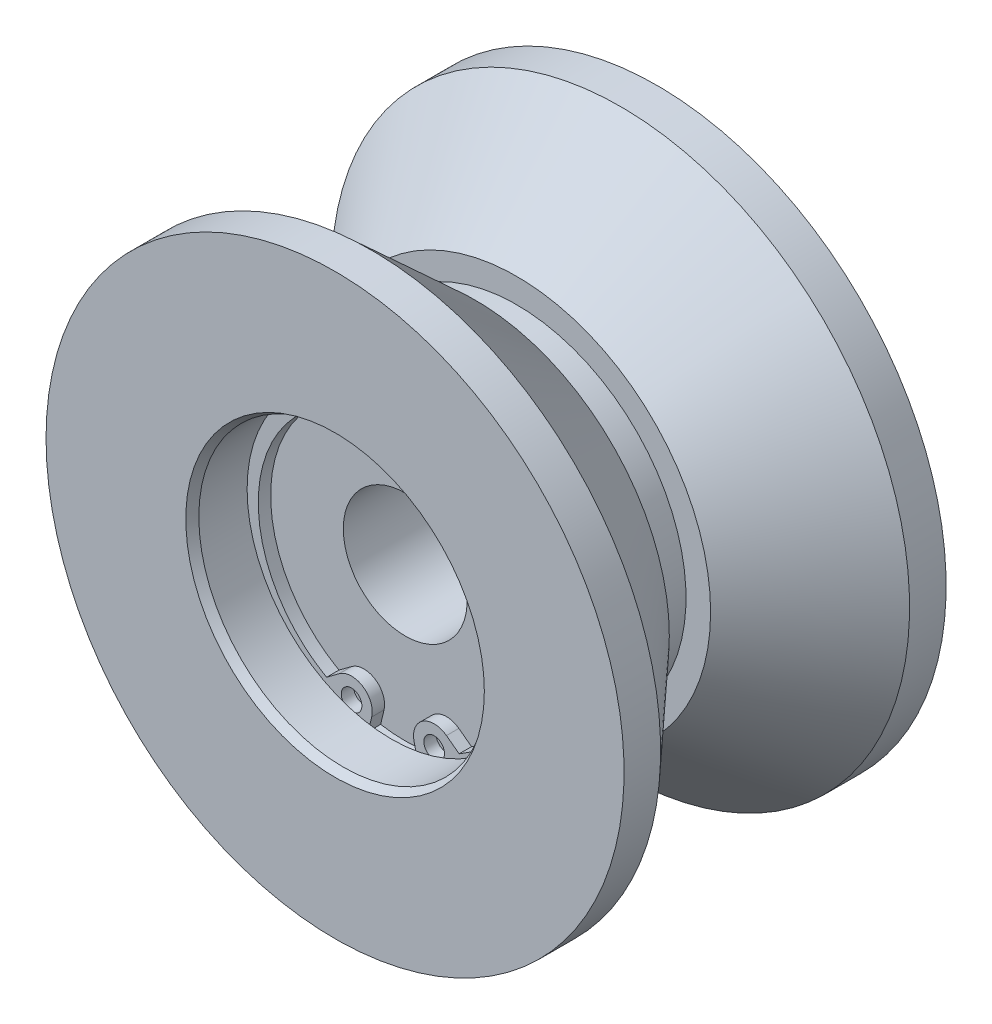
ISO-10303-21;
HEADER;
FILE_DESCRIPTION(('STEP AP214'),'2;1');
FILE_NAME('part.step','',(''),(''),'','','');
FILE_SCHEMA(('AUTOMOTIVE_DESIGN { 1 0 10303 214 1 1 1 1 }'));
ENDSEC;
DATA;
#1=APPLICATION_CONTEXT('core data for automotive mechanical design processes');
#2=APPLICATION_PROTOCOL_DEFINITION('international standard','automotive_design',2000,#1);
#3=PRODUCT_CONTEXT('',#1,'mechanical');
#4=PRODUCT('Part','Part','',(#3));
#5=PRODUCT_RELATED_PRODUCT_CATEGORY('part','',(#4));
#6=PRODUCT_DEFINITION_FORMATION('','',#4);
#7=PRODUCT_DEFINITION_CONTEXT('part definition',#1,'design');
#8=PRODUCT_DEFINITION('design','',#6,#7);
#9=PRODUCT_DEFINITION_SHAPE('','',#8);
#10=(LENGTH_UNIT() NAMED_UNIT(*) SI_UNIT(.MILLI.,.METRE.));
#11=(NAMED_UNIT(*) PLANE_ANGLE_UNIT() SI_UNIT($,.RADIAN.));
#12=(NAMED_UNIT(*) SI_UNIT($,.STERADIAN.) SOLID_ANGLE_UNIT());
#13=UNCERTAINTY_MEASURE_WITH_UNIT(LENGTH_MEASURE(1.E-05),#10,'distance_accuracy_value','');
#14=(GEOMETRIC_REPRESENTATION_CONTEXT(3) GLOBAL_UNCERTAINTY_ASSIGNED_CONTEXT((#13)) GLOBAL_UNIT_ASSIGNED_CONTEXT((#10,
#11,#12)) REPRESENTATION_CONTEXT('',''));
#15=CARTESIAN_POINT('',(0.,0.,0.));
#16=DIRECTION('',(0.,0.,1.));
#17=DIRECTION('',(1.,0.,0.));
#18=AXIS2_PLACEMENT_3D('',#15,#16,#17);
#19=CARTESIAN_POINT('',(0.,-0.9,12.6));
#20=DIRECTION('',(0.,0.,1.));
#21=DIRECTION('',(-1.,0.,0.));
#22=AXIS2_PLACEMENT_3D('',#19,#20,#21);
#23=CYLINDRICAL_SURFACE('',#22,16.3);
#24=CARTESIAN_POINT('',(0.,-0.9,12.5));
#25=DIRECTION('',(0.,0.,1.));
#26=DIRECTION('',(1.,0.,0.));
#27=AXIS2_PLACEMENT_3D('',#24,#25,#26);
#28=CIRCLE('',#27,16.3);
#29=CARTESIAN_POINT('',(-8.02922574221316,-15.0852576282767,12.5));
#30=VERTEX_POINT('',#29);
#31=CARTESIAN_POINT('',(8.02922574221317,-15.0852576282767,12.5));
#32=VERTEX_POINT('',#31);
#33=EDGE_CURVE('E229',#30,#32,#28,.F.);
#34=ORIENTED_EDGE('',*,*,#33,.F.);
#35=DIRECTION('',(0.,0.,-1.));
#36=VECTOR('',#35,1.);
#37=CARTESIAN_POINT('',(-8.02922574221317,-15.0852576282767,12.6));
#38=LINE('',#37,#36);
#39=CARTESIAN_POINT('',(-8.02922574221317,-15.0852576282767,11.));
#40=VERTEX_POINT('',#39);
#41=EDGE_CURVE('E186',#30,#40,#38,.T.);
#42=ORIENTED_EDGE('',*,*,#41,.T.);
#43=CARTESIAN_POINT('',(0.,-0.9,11.));
#44=DIRECTION('',(0.,0.,-1.));
#45=DIRECTION('',(0.,-1.,0.));
#46=AXIS2_PLACEMENT_3D('',#43,#44,#45);
#47=CIRCLE('',#46,16.3);
#48=CARTESIAN_POINT('',(8.02922574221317,-15.0852576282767,11.));
#49=VERTEX_POINT('',#48);
#50=EDGE_CURVE('E189',#40,#49,#47,.T.);
#51=ORIENTED_EDGE('',*,*,#50,.T.);
#52=DIRECTION('',(0.,0.,-1.));
#53=VECTOR('',#52,1.);
#54=CARTESIAN_POINT('',(8.02922574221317,-15.0852576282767,12.6));
#55=LINE('',#54,#53);
#56=EDGE_CURVE('E182',#32,#49,#55,.T.);
#57=ORIENTED_EDGE('',*,*,#56,.F.);
#58=EDGE_LOOP('',(#34,#42,#51,#57));
#59=FACE_BOUND('',#58,.T.);
#60=ADVANCED_FACE('F14',(#59),#23,.F.);
#61=CARTESIAN_POINT('',(6.49138441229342,-13.9421779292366,12.6));
#62=DIRECTION('',(-0.596553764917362,-0.802573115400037,0.));
#63=DIRECTION('',(-0.802573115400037,0.596553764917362,0.));
#64=AXIS2_PLACEMENT_3D('',#61,#62,#63);
#65=PLANE('',#64);
#66=DIRECTION('',(-0.802573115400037,0.596553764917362,0.));
#67=VECTOR('',#66,1.);
#68=CARTESIAN_POINT('',(6.49138441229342,-13.9421779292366,12.5));
#69=LINE('',#68,#67);
#70=CARTESIAN_POINT('',(6.49138441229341,-13.9421779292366,12.5));
#71=VERTEX_POINT('',#70);
#72=EDGE_CURVE('E227',#32,#71,#69,.T.);
#73=ORIENTED_EDGE('',*,*,#72,.F.);
#74=ORIENTED_EDGE('',*,*,#56,.T.);
#75=DIRECTION('',(-0.802573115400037,0.596553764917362,0.));
#76=VECTOR('',#75,1.);
#77=CARTESIAN_POINT('',(6.49138441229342,-13.9421779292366,11.));
#78=LINE('',#77,#76);
#79=CARTESIAN_POINT('',(6.49138441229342,-13.9421779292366,11.));
#80=VERTEX_POINT('',#79);
#81=EDGE_CURVE('E185',#49,#80,#78,.T.);
#82=ORIENTED_EDGE('',*,*,#81,.T.);
#83=DIRECTION('',(0.,0.,-1.));
#84=VECTOR('',#83,1.);
#85=CARTESIAN_POINT('',(6.49138441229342,-13.9421779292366,12.6));
#86=LINE('',#85,#84);
#87=EDGE_CURVE('E180',#71,#80,#86,.T.);
#88=ORIENTED_EDGE('',*,*,#87,.F.);
#89=EDGE_LOOP('',(#73,#74,#82,#88));
#90=FACE_BOUND('',#89,.T.);
#91=ADVANCED_FACE('F212',(#90),#65,.F.);
#92=CARTESIAN_POINT('',(5.,-15.9486107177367,12.6));
#93=DIRECTION('',(0.,0.,1.));
#94=DIRECTION('',(-1.,0.,0.));
#95=AXIS2_PLACEMENT_3D('',#92,#93,#94);
#96=CYLINDRICAL_SURFACE('',#95,2.5);
#97=DIRECTION('',(0.,0.,-1.));
#98=VECTOR('',#97,1.);
#99=CARTESIAN_POINT('',(2.5678231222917,-16.526983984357,12.6));
#100=LINE('',#99,#98);
#101=CARTESIAN_POINT('',(2.5678231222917,-16.526983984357,12.5));
#102=VERTEX_POINT('',#101);
#103=CARTESIAN_POINT('',(2.5678231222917,-16.526983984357,11.));
#104=VERTEX_POINT('',#103);
#105=EDGE_CURVE('E191',#102,#104,#100,.T.);
#106=ORIENTED_EDGE('',*,*,#105,.F.);
#107=CARTESIAN_POINT('',(5.,-15.9486107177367,12.5));
#108=DIRECTION('',(0.,0.,1.));
#109=DIRECTION('',(1.,0.,0.));
#110=AXIS2_PLACEMENT_3D('',#107,#108,#109);
#111=CIRCLE('',#110,2.5);
#112=EDGE_CURVE('E29',#102,#71,#111,.F.);
#113=ORIENTED_EDGE('',*,*,#112,.T.);
#114=ORIENTED_EDGE('',*,*,#87,.T.);
#115=CARTESIAN_POINT('',(5.,-15.9486107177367,11.));
#116=DIRECTION('',(0.,0.,1.));
#117=DIRECTION('',(1.,0.,0.));
#118=AXIS2_PLACEMENT_3D('',#115,#116,#117);
#119=CIRCLE('',#118,2.5);
#120=EDGE_CURVE('E118',#80,#104,#119,.T.);
#121=ORIENTED_EDGE('',*,*,#120,.T.);
#122=EDGE_LOOP('',(#106,#113,#114,#121));
#123=FACE_BOUND('',#122,.T.);
#124=ADVANCED_FACE('F226',(#123),#96,.T.);
#125=CARTESIAN_POINT('',(-2.56782312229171,-16.526983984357,12.6));
#126=DIRECTION('',(-0.97287075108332,0.231349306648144,0.));
#127=DIRECTION('',(0.,0.,1.));
#128=AXIS2_PLACEMENT_3D('',#125,#126,#127);
#129=PLANE('',#128);
#130=DIRECTION('',(0.231349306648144,0.97287075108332,0.));
#131=VECTOR('',#130,1.);
#132=CARTESIAN_POINT('',(-2.56782312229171,-16.526983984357,12.5));
#133=LINE('',#132,#131);
#134=CARTESIAN_POINT('',(-2.97957431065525,-18.2584812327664,12.5));
#135=VERTEX_POINT('',#134);
#136=CARTESIAN_POINT('',(-2.5678231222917,-16.526983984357,12.5));
#137=VERTEX_POINT('',#136);
#138=EDGE_CURVE('E88',#135,#137,#133,.T.);
#139=ORIENTED_EDGE('',*,*,#138,.F.);
#140=DIRECTION('',(0.,0.,-1.));
#141=VECTOR('',#140,1.);
#142=CARTESIAN_POINT('',(-2.97957431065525,-18.2584812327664,12.65));
#143=LINE('',#142,#141);
#144=CARTESIAN_POINT('',(-2.97957431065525,-18.2584812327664,11.));
#145=VERTEX_POINT('',#144);
#146=EDGE_CURVE('E98',#135,#145,#143,.T.);
#147=ORIENTED_EDGE('',*,*,#146,.T.);
#148=DIRECTION('',(0.231349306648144,0.97287075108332,0.));
#149=VECTOR('',#148,1.);
#150=CARTESIAN_POINT('',(-2.56782312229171,-16.526983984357,11.));
#151=LINE('',#150,#149);
#152=CARTESIAN_POINT('',(-2.56782312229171,-16.526983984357,11.));
#153=VERTEX_POINT('',#152);
#154=EDGE_CURVE('E196',#145,#153,#151,.T.);
#155=ORIENTED_EDGE('',*,*,#154,.T.);
#156=DIRECTION('',(0.,0.,-1.));
#157=VECTOR('',#156,1.);
#158=CARTESIAN_POINT('',(-2.56782312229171,-16.526983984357,12.6));
#159=LINE('',#158,#157);
#160=EDGE_CURVE('E100',#137,#153,#159,.T.);
#161=ORIENTED_EDGE('',*,*,#160,.F.);
#162=EDGE_LOOP('',(#139,#147,#155,#161));
#163=FACE_BOUND('',#162,.T.);
#164=ADVANCED_FACE('F96',(#163),#129,.F.);
#165=CARTESIAN_POINT('',(-6.49138441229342,-13.9421779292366,12.6));
#166=DIRECTION('',(0.596553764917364,-0.802573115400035,0.));
#167=DIRECTION('',(0.,0.,-1.));
#168=AXIS2_PLACEMENT_3D('',#165,#166,#167);
#169=PLANE('',#168);
#170=DIRECTION('',(-0.802573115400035,-0.596553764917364,0.));
#171=VECTOR('',#170,1.);
#172=CARTESIAN_POINT('',(-6.49138441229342,-13.9421779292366,12.5));
#173=LINE('',#172,#171);
#174=CARTESIAN_POINT('',(-6.49138441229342,-13.9421779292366,12.5));
#175=VERTEX_POINT('',#174);
#176=EDGE_CURVE('E234',#175,#30,#173,.T.);
#177=ORIENTED_EDGE('',*,*,#176,.F.);
#178=DIRECTION('',(0.,0.,-1.));
#179=VECTOR('',#178,1.);
#180=CARTESIAN_POINT('',(-6.49138441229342,-13.9421779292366,12.6));
#181=LINE('',#180,#179);
#182=CARTESIAN_POINT('',(-6.49138441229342,-13.9421779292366,11.));
#183=VERTEX_POINT('',#182);
#184=EDGE_CURVE('E114',#175,#183,#181,.T.);
#185=ORIENTED_EDGE('',*,*,#184,.T.);
#186=DIRECTION('',(-0.802573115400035,-0.596553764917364,0.));
#187=VECTOR('',#186,1.);
#188=CARTESIAN_POINT('',(-6.49138441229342,-13.9421779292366,11.));
#189=LINE('',#188,#187);
#190=EDGE_CURVE('E109',#183,#40,#189,.T.);
#191=ORIENTED_EDGE('',*,*,#190,.T.);
#192=ORIENTED_EDGE('',*,*,#41,.F.);
#193=EDGE_LOOP('',(#177,#185,#191,#192));
#194=FACE_BOUND('',#193,.T.);
#195=ADVANCED_FACE('F250',(#194),#169,.F.);
#196=CARTESIAN_POINT('',(-5.,-15.9486107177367,12.6));
#197=DIRECTION('',(0.,0.,1.));
#198=DIRECTION('',(-1.,0.,0.));
#199=AXIS2_PLACEMENT_3D('',#196,#197,#198);
#200=CYLINDRICAL_SURFACE('',#199,2.5);
#201=ORIENTED_EDGE('',*,*,#184,.F.);
#202=CARTESIAN_POINT('',(-5.,-15.9486107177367,12.5));
#203=DIRECTION('',(0.,0.,1.));
#204=DIRECTION('',(1.,0.,0.));
#205=AXIS2_PLACEMENT_3D('',#202,#203,#204);
#206=CIRCLE('',#205,2.5);
#207=EDGE_CURVE('E102',#175,#137,#206,.F.);
#208=ORIENTED_EDGE('',*,*,#207,.T.);
#209=ORIENTED_EDGE('',*,*,#160,.T.);
#210=CARTESIAN_POINT('',(-5.,-15.9486107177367,11.));
#211=DIRECTION('',(0.,0.,1.));
#212=DIRECTION('',(-1.,0.,0.));
#213=AXIS2_PLACEMENT_3D('',#210,#211,#212);
#214=CIRCLE('',#213,2.5);
#215=EDGE_CURVE('E176',#153,#183,#214,.T.);
#216=ORIENTED_EDGE('',*,*,#215,.T.);
#217=EDGE_LOOP('',(#201,#208,#209,#216));
#218=FACE_BOUND('',#217,.T.);
#219=ADVANCED_FACE('F253',(#218),#200,.T.);
#220=CARTESIAN_POINT('',(2.5678231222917,-16.526983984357,12.6));
#221=DIRECTION('',(0.972870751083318,0.231349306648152,0.));
#222=DIRECTION('',(0.,0.,-1.));
#223=AXIS2_PLACEMENT_3D('',#220,#221,#222);
#224=PLANE('',#223);
#225=DIRECTION('',(0.231349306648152,-0.972870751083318,0.));
#226=VECTOR('',#225,1.);
#227=CARTESIAN_POINT('',(2.5678231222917,-16.526983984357,12.5));
#228=LINE('',#227,#226);
#229=CARTESIAN_POINT('',(2.97957431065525,-18.2584812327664,12.5));
#230=VERTEX_POINT('',#229);
#231=EDGE_CURVE('E22',#102,#230,#228,.T.);
#232=ORIENTED_EDGE('',*,*,#231,.F.);
#233=ORIENTED_EDGE('',*,*,#105,.T.);
#234=DIRECTION('',(0.231349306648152,-0.972870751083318,0.));
#235=VECTOR('',#234,1.);
#236=CARTESIAN_POINT('',(2.5678231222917,-16.526983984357,11.));
#237=LINE('',#236,#235);
#238=CARTESIAN_POINT('',(2.97957431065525,-18.2584812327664,11.));
#239=VERTEX_POINT('',#238);
#240=EDGE_CURVE('E37',#104,#239,#237,.T.);
#241=ORIENTED_EDGE('',*,*,#240,.T.);
#242=DIRECTION('',(0.,0.,-1.));
#243=VECTOR('',#242,1.);
#244=CARTESIAN_POINT('',(2.97957431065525,-18.2584812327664,12.65));
#245=LINE('',#244,#243);
#246=EDGE_CURVE('E108',#239,#230,#245,.F.);
#247=ORIENTED_EDGE('',*,*,#246,.T.);
#248=EDGE_LOOP('',(#232,#233,#241,#247));
#249=FACE_BOUND('',#248,.T.);
#250=ADVANCED_FACE('F255',(#249),#224,.F.);
#251=CARTESIAN_POINT('',(0.,0.,-24.5));
#252=DIRECTION('',(0.,0.,-1.));
#253=DIRECTION('',(-1.,0.,0.));
#254=AXIS2_PLACEMENT_3D('',#251,#252,#253);
#255=CYLINDRICAL_SURFACE('',#254,17.5);
#256=CARTESIAN_POINT('',(0.,0.,18.5));
#257=DIRECTION('',(0.,0.,1.));
#258=DIRECTION('',(1.,0.,0.));
#259=AXIS2_PLACEMENT_3D('',#256,#257,#258);
#260=CIRCLE('',#259,17.5);
#261=CARTESIAN_POINT('',(17.5,0.,18.5));
#262=VERTEX_POINT('',#261);
#263=EDGE_CURVE('E161',#262,#262,#260,.T.);
#264=ORIENTED_EDGE('',*,*,#263,.T.);
#265=EDGE_LOOP('',(#264));
#266=FACE_BOUND('',#265,.T.);
#267=CARTESIAN_POINT('',(0.,0.,12.65));
#268=DIRECTION('',(0.,0.,-1.));
#269=DIRECTION('',(-1.,0.,0.));
#270=AXIS2_PLACEMENT_3D('',#267,#268,#269);
#271=CIRCLE('',#270,17.5);
#272=CARTESIAN_POINT('',(-17.5,0.,12.65));
#273=VERTEX_POINT('',#272);
#274=EDGE_CURVE('E92',#273,#273,#271,.T.);
#275=ORIENTED_EDGE('',*,*,#274,.T.);
#276=EDGE_LOOP('',(#275));
#277=FACE_BOUND('',#276,.T.);
#278=ADVANCED_FACE('F262',(#266,#277),#255,.F.);
#279=CARTESIAN_POINT('',(0.,0.,-24.5));
#280=DIRECTION('',(0.,0.,-1.));
#281=DIRECTION('',(-1.,0.,0.));
#282=AXIS2_PLACEMENT_3D('',#279,#280,#281);
#283=CYLINDRICAL_SURFACE('',#282,20.5);
#284=CARTESIAN_POINT('',(0.,0.,2.5));
#285=DIRECTION('',(0.,0.,-1.));
#286=DIRECTION('',(-1.,0.,0.));
#287=AXIS2_PLACEMENT_3D('',#284,#285,#286);
#288=CIRCLE('',#287,20.5);
#289=CARTESIAN_POINT('',(-20.5,0.,2.5));
#290=VERTEX_POINT('',#289);
#291=EDGE_CURVE('E134',#290,#290,#288,.T.);
#292=ORIENTED_EDGE('',*,*,#291,.T.);
#293=EDGE_LOOP('',(#292));
#294=FACE_BOUND('',#293,.T.);
#295=CARTESIAN_POINT('',(0.,0.,-2.5));
#296=DIRECTION('',(0.,0.,-1.));
#297=DIRECTION('',(-1.,0.,0.));
#298=AXIS2_PLACEMENT_3D('',#295,#296,#297);
#299=CIRCLE('',#298,20.5);
#300=CARTESIAN_POINT('',(-20.5,0.,-2.5));
#301=VERTEX_POINT('',#300);
#302=EDGE_CURVE('E131',#301,#301,#299,.T.);
#303=ORIENTED_EDGE('',*,*,#302,.F.);
#304=EDGE_LOOP('',(#303));
#305=FACE_BOUND('',#304,.T.);
#306=ADVANCED_FACE('F349',(#294,#305),#283,.T.);
#307=CARTESIAN_POINT('',(0.,23.4780763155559,2.5));
#308=DIRECTION('',(0.,0.,-1.));
#309=DIRECTION('',(-1.,0.,0.));
#310=AXIS2_PLACEMENT_3D('',#307,#308,#309);
#311=PLANE('',#310);
#312=CARTESIAN_POINT('',(0.,0.,2.5));
#313=DIRECTION('',(0.,0.,-1.));
#314=DIRECTION('',(-1.,0.,0.));
#315=AXIS2_PLACEMENT_3D('',#312,#313,#314);
#316=CIRCLE('',#315,23.4780763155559);
#317=CARTESIAN_POINT('',(-23.4780763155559,0.,2.5));
#318=VERTEX_POINT('',#317);
#319=EDGE_CURVE('E137',#318,#318,#316,.T.);
#320=ORIENTED_EDGE('',*,*,#319,.T.);
#321=EDGE_LOOP('',(#320));
#322=FACE_BOUND('',#321,.T.);
#323=ORIENTED_EDGE('',*,*,#291,.F.);
#324=EDGE_LOOP('',(#323));
#325=FACE_BOUND('',#324,.T.);
#326=ADVANCED_FACE('F359',(#322,#325),#311,.T.);
#327=CARTESIAN_POINT('',(0.,23.4780763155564,-2.5));
#328=DIRECTION('',(0.,0.,1.));
#329=DIRECTION('',(1.,0.,0.));
#330=AXIS2_PLACEMENT_3D('',#327,#328,#329);
#331=PLANE('',#330);
#332=ORIENTED_EDGE('',*,*,#302,.T.);
#333=EDGE_LOOP('',(#332));
#334=FACE_BOUND('',#333,.T.);
#335=CARTESIAN_POINT('',(0.,0.,-2.5));
#336=DIRECTION('',(0.,0.,-1.));
#337=DIRECTION('',(-1.,0.,0.));
#338=AXIS2_PLACEMENT_3D('',#335,#336,#337);
#339=CIRCLE('',#338,23.4780763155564);
#340=CARTESIAN_POINT('',(-23.4780763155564,0.,-2.5));
#341=VERTEX_POINT('',#340);
#342=EDGE_CURVE('E128',#341,#341,#339,.T.);
#343=ORIENTED_EDGE('',*,*,#342,.F.);
#344=EDGE_LOOP('',(#343));
#345=FACE_BOUND('',#344,.T.);
#346=ADVANCED_FACE('F370',(#334,#345),#331,.T.);
#347=CARTESIAN_POINT('',(0.,0.,2.5));
#348=DIRECTION('',(0.,0.,1.));
#349=DIRECTION('',(1.,0.,0.));
#350=AXIS2_PLACEMENT_3D('',#347,#348,#349);
#351=CONICAL_SURFACE('',#350,23.4780763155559,0.741764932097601);
#352=CARTESIAN_POINT('',(0.,0.,15.0739732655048));
#353=DIRECTION('',(0.,0.,-1.));
#354=DIRECTION('',(-1.,0.,0.));
#355=AXIS2_PLACEMENT_3D('',#352,#353,#354);
#356=CIRCLE('',#355,35.);
#357=CARTESIAN_POINT('',(-35.,0.,15.0739732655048));
#358=VERTEX_POINT('',#357);
#359=EDGE_CURVE('E140',#358,#358,#356,.T.);
#360=ORIENTED_EDGE('',*,*,#359,.T.);
#361=EDGE_LOOP('',(#360));
#362=FACE_BOUND('',#361,.T.);
#363=ORIENTED_EDGE('',*,*,#319,.F.);
#364=EDGE_LOOP('',(#363));
#365=FACE_BOUND('',#364,.T.);
#366=ADVANCED_FACE('F380',(#362,#365),#351,.T.);
#367=CARTESIAN_POINT('',(0.,0.,-15.0739732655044));
#368=DIRECTION('',(0.,0.,-1.));
#369=DIRECTION('',(-1.,0.,0.));
#370=AXIS2_PLACEMENT_3D('',#367,#368,#369);
#371=CONICAL_SURFACE('',#370,34.9999999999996,0.741764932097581);
#372=ORIENTED_EDGE('',*,*,#342,.T.);
#373=EDGE_LOOP('',(#372));
#374=FACE_BOUND('',#373,.T.);
#375=CARTESIAN_POINT('',(0.,0.,-15.0739732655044));
#376=DIRECTION('',(0.,0.,-1.));
#377=DIRECTION('',(-1.,0.,0.));
#378=AXIS2_PLACEMENT_3D('',#375,#376,#377);
#379=CIRCLE('',#378,34.9999999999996);
#380=CARTESIAN_POINT('',(-34.9999999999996,0.,-15.0739732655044));
#381=VERTEX_POINT('',#380);
#382=EDGE_CURVE('E125',#381,#381,#379,.T.);
#383=ORIENTED_EDGE('',*,*,#382,.F.);
#384=EDGE_LOOP('',(#383));
#385=FACE_BOUND('',#384,.T.);
#386=ADVANCED_FACE('F390',(#374,#385),#371,.T.);
#387=CARTESIAN_POINT('',(0.,0.,-24.5));
#388=DIRECTION('',(0.,0.,-1.));
#389=DIRECTION('',(-1.,0.,0.));
#390=AXIS2_PLACEMENT_3D('',#387,#388,#389);
#391=CYLINDRICAL_SURFACE('',#390,35.);
#392=CARTESIAN_POINT('',(0.,0.,19.5));
#393=DIRECTION('',(0.,0.,-1.));
#394=DIRECTION('',(-1.,0.,0.));
#395=AXIS2_PLACEMENT_3D('',#392,#393,#394);
#396=CIRCLE('',#395,35.);
#397=CARTESIAN_POINT('',(-35.,0.,19.5));
#398=VERTEX_POINT('',#397);
#399=EDGE_CURVE('E143',#398,#398,#396,.T.);
#400=ORIENTED_EDGE('',*,*,#399,.T.);
#401=EDGE_LOOP('',(#400));
#402=FACE_BOUND('',#401,.T.);
#403=ORIENTED_EDGE('',*,*,#359,.F.);
#404=EDGE_LOOP('',(#403));
#405=FACE_BOUND('',#404,.T.);
#406=ADVANCED_FACE('F400',(#402,#405),#391,.T.);
#407=CARTESIAN_POINT('',(0.,0.,-24.5));
#408=DIRECTION('',(0.,0.,-1.));
#409=DIRECTION('',(-1.,0.,0.));
#410=AXIS2_PLACEMENT_3D('',#407,#408,#409);
#411=CYLINDRICAL_SURFACE('',#410,34.9999999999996);
#412=ORIENTED_EDGE('',*,*,#382,.T.);
#413=EDGE_LOOP('',(#412));
#414=FACE_BOUND('',#413,.T.);
#415=CARTESIAN_POINT('',(0.,0.,-19.5));
#416=DIRECTION('',(0.,0.,-1.));
#417=DIRECTION('',(-1.,0.,0.));
#418=AXIS2_PLACEMENT_3D('',#415,#416,#417);
#419=CIRCLE('',#418,34.9999999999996);
#420=CARTESIAN_POINT('',(-34.9999999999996,0.,-19.5));
#421=VERTEX_POINT('',#420);
#422=EDGE_CURVE('E121',#421,#421,#419,.T.);
#423=ORIENTED_EDGE('',*,*,#422,.F.);
#424=EDGE_LOOP('',(#423));
#425=FACE_BOUND('',#424,.T.);
#426=ADVANCED_FACE('F410',(#414,#425),#411,.T.);
#427=CARTESIAN_POINT('',(0.,17.5,19.5));
#428=DIRECTION('',(0.,0.,1.));
#429=DIRECTION('',(1.,0.,0.));
#430=AXIS2_PLACEMENT_3D('',#427,#428,#429);
#431=PLANE('',#430);
#432=CARTESIAN_POINT('',(0.,0.,19.5));
#433=DIRECTION('',(0.,0.,1.));
#434=DIRECTION('',(1.,0.,0.));
#435=AXIS2_PLACEMENT_3D('',#432,#433,#434);
#436=CIRCLE('',#435,18.0773502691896);
#437=CARTESIAN_POINT('',(18.0773502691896,0.,19.5));
#438=VERTEX_POINT('',#437);
#439=EDGE_CURVE('E158',#438,#438,#436,.F.);
#440=ORIENTED_EDGE('',*,*,#439,.T.);
#441=EDGE_LOOP('',(#440));
#442=FACE_BOUND('',#441,.T.);
#443=ORIENTED_EDGE('',*,*,#399,.F.);
#444=EDGE_LOOP('',(#443));
#445=FACE_BOUND('',#444,.T.);
#446=ADVANCED_FACE('F420',(#442,#445),#431,.T.);
#447=CARTESIAN_POINT('',(0.,14.4999999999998,-19.5));
#448=DIRECTION('',(0.,0.,-1.));
#449=DIRECTION('',(-1.,0.,0.));
#450=AXIS2_PLACEMENT_3D('',#447,#448,#449);
#451=PLANE('',#450);
#452=ORIENTED_EDGE('',*,*,#422,.T.);
#453=EDGE_LOOP('',(#452));
#454=FACE_BOUND('',#453,.T.);
#455=CARTESIAN_POINT('',(0.,0.,-19.5));
#456=DIRECTION('',(0.,0.,-1.));
#457=DIRECTION('',(-1.,0.,0.));
#458=AXIS2_PLACEMENT_3D('',#455,#456,#457);
#459=CIRCLE('',#458,14.4999999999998);
#460=CARTESIAN_POINT('',(-14.4999999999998,0.,-19.5));
#461=VERTEX_POINT('',#460);
#462=EDGE_CURVE('E155',#461,#461,#459,.T.);
#463=ORIENTED_EDGE('',*,*,#462,.F.);
#464=EDGE_LOOP('',(#463));
#465=FACE_BOUND('',#464,.T.);
#466=ADVANCED_FACE('F430',(#454,#465),#451,.T.);
#467=CARTESIAN_POINT('',(0.,0.,19.5));
#468=DIRECTION('',(0.,0.,1.));
#469=DIRECTION('',(1.,0.,0.));
#470=AXIS2_PLACEMENT_3D('',#467,#468,#469);
#471=CONICAL_SURFACE('',#470,18.0773502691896,0.523598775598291);
#472=ORIENTED_EDGE('',*,*,#263,.F.);
#473=EDGE_LOOP('',(#472));
#474=FACE_BOUND('',#473,.T.);
#475=ORIENTED_EDGE('',*,*,#439,.F.);
#476=EDGE_LOOP('',(#475));
#477=FACE_BOUND('',#476,.T.);
#478=ADVANCED_FACE('F16',(#474,#477),#471,.F.);
#479=CARTESIAN_POINT('',(0.,0.,-24.5));
#480=DIRECTION('',(0.,0.,-1.));
#481=DIRECTION('',(-1.,0.,0.));
#482=AXIS2_PLACEMENT_3D('',#479,#480,#481);
#483=CYLINDRICAL_SURFACE('',#482,14.4999999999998);
#484=ORIENTED_EDGE('',*,*,#462,.T.);
#485=EDGE_LOOP('',(#484));
#486=FACE_BOUND('',#485,.T.);
#487=CARTESIAN_POINT('',(0.,0.,-11.));
#488=DIRECTION('',(0.,0.,-1.));
#489=DIRECTION('',(-1.,0.,0.));
#490=AXIS2_PLACEMENT_3D('',#487,#488,#489);
#491=CIRCLE('',#490,14.4999999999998);
#492=CARTESIAN_POINT('',(-14.4999999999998,0.,-11.));
#493=VERTEX_POINT('',#492);
#494=EDGE_CURVE('E152',#493,#493,#491,.T.);
#495=ORIENTED_EDGE('',*,*,#494,.F.);
#496=EDGE_LOOP('',(#495));
#497=FACE_BOUND('',#496,.T.);
#498=ADVANCED_FACE('F449',(#486,#497),#483,.F.);
#499=CARTESIAN_POINT('',(0.,14.4999999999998,-11.));
#500=DIRECTION('',(0.,0.,-1.));
#501=DIRECTION('',(-1.,0.,0.));
#502=AXIS2_PLACEMENT_3D('',#499,#500,#501);
#503=PLANE('',#502);
#504=ORIENTED_EDGE('',*,*,#494,.T.);
#505=EDGE_LOOP('',(#504));
#506=FACE_BOUND('',#505,.T.);
#507=CARTESIAN_POINT('',(0.,0.,-11.));
#508=DIRECTION('',(0.,0.,-1.));
#509=DIRECTION('',(-1.,0.,0.));
#510=AXIS2_PLACEMENT_3D('',#507,#508,#509);
#511=CIRCLE('',#510,7.49999999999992);
#512=CARTESIAN_POINT('',(-7.49999999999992,0.,-11.));
#513=VERTEX_POINT('',#512);
#514=EDGE_CURVE('E149',#513,#513,#511,.T.);
#515=ORIENTED_EDGE('',*,*,#514,.F.);
#516=EDGE_LOOP('',(#515));
#517=FACE_BOUND('',#516,.T.);
#518=ADVANCED_FACE('F457',(#506,#517),#503,.T.);
#519=CARTESIAN_POINT('',(0.,0.,12.65));
#520=DIRECTION('',(0.,0.,-1.));
#521=DIRECTION('',(-1.,0.,0.));
#522=AXIS2_PLACEMENT_3D('',#519,#520,#521);
#523=CYLINDRICAL_SURFACE('',#522,18.5);
#524=CARTESIAN_POINT('',(0.,0.,12.65));
#525=DIRECTION('',(0.,0.,-1.));
#526=DIRECTION('',(-1.,0.,0.));
#527=AXIS2_PLACEMENT_3D('',#524,#525,#526);
#528=CIRCLE('',#527,18.5);
#529=CARTESIAN_POINT('',(-18.5,0.,12.65));
#530=VERTEX_POINT('',#529);
#531=EDGE_CURVE('E9',#530,#530,#528,.T.);
#532=ORIENTED_EDGE('',*,*,#531,.F.);
#533=EDGE_LOOP('',(#532));
#534=FACE_BOUND('',#533,.T.);
#535=CARTESIAN_POINT('',(0.,0.,12.5));
#536=DIRECTION('',(0.,0.,1.));
#537=DIRECTION('',(1.,0.,0.));
#538=AXIS2_PLACEMENT_3D('',#535,#536,#537);
#539=CIRCLE('',#538,18.5);
#540=EDGE_CURVE('E84',#230,#135,#539,.T.);
#541=ORIENTED_EDGE('',*,*,#540,.F.);
#542=ORIENTED_EDGE('',*,*,#246,.F.);
#543=CARTESIAN_POINT('',(0.,0.,11.));
#544=DIRECTION('',(0.,0.,1.));
#545=DIRECTION('',(1.,0.,0.));
#546=AXIS2_PLACEMENT_3D('',#543,#544,#545);
#547=CIRCLE('',#546,18.5);
#548=EDGE_CURVE('E107',#145,#239,#547,.T.);
#549=ORIENTED_EDGE('',*,*,#548,.F.);
#550=ORIENTED_EDGE('',*,*,#146,.F.);
#551=EDGE_LOOP('',(#541,#542,#549,#550));
#552=FACE_BOUND('',#551,.T.);
#553=ADVANCED_FACE('F105',(#534,#552),#523,.F.);
#554=CARTESIAN_POINT('',(0.,0.,-24.5));
#555=DIRECTION('',(0.,0.,-1.));
#556=DIRECTION('',(-1.,0.,0.));
#557=AXIS2_PLACEMENT_3D('',#554,#555,#556);
#558=CYLINDRICAL_SURFACE('',#557,7.49999999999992);
#559=ORIENTED_EDGE('',*,*,#514,.T.);
#560=EDGE_LOOP('',(#559));
#561=FACE_BOUND('',#560,.T.);
#562=CARTESIAN_POINT('',(0.,0.,11.));
#563=DIRECTION('',(0.,0.,-1.));
#564=DIRECTION('',(-1.,0.,0.));
#565=AXIS2_PLACEMENT_3D('',#562,#563,#564);
#566=CIRCLE('',#565,7.49999999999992);
#567=CARTESIAN_POINT('',(-7.49999999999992,0.,11.));
#568=VERTEX_POINT('',#567);
#569=EDGE_CURVE('E146',#568,#568,#566,.T.);
#570=ORIENTED_EDGE('',*,*,#569,.F.);
#571=EDGE_LOOP('',(#570));
#572=FACE_BOUND('',#571,.T.);
#573=ADVANCED_FACE('F302',(#561,#572),#558,.F.);
#574=CARTESIAN_POINT('',(0.,17.5,11.));
#575=DIRECTION('',(0.,0.,1.));
#576=DIRECTION('',(1.,0.,0.));
#577=AXIS2_PLACEMENT_3D('',#574,#575,#576);
#578=PLANE('',#577);
#579=ORIENTED_EDGE('',*,*,#569,.T.);
#580=EDGE_LOOP('',(#579));
#581=FACE_BOUND('',#580,.T.);
#582=ORIENTED_EDGE('',*,*,#240,.F.);
#583=ORIENTED_EDGE('',*,*,#120,.F.);
#584=ORIENTED_EDGE('',*,*,#81,.F.);
#585=ORIENTED_EDGE('',*,*,#50,.F.);
#586=ORIENTED_EDGE('',*,*,#190,.F.);
#587=ORIENTED_EDGE('',*,*,#215,.F.);
#588=ORIENTED_EDGE('',*,*,#154,.F.);
#589=ORIENTED_EDGE('',*,*,#548,.T.);
#590=EDGE_LOOP('',(#582,#583,#584,#585,#586,#587,#588,#589));
#591=FACE_BOUND('',#590,.T.);
#592=ADVANCED_FACE('F218',(#581,#591),#578,.T.);
#593=CARTESIAN_POINT('',(0.,0.,12.5));
#594=DIRECTION('',(0.,0.,1.));
#595=DIRECTION('',(1.,0.,0.));
#596=AXIS2_PLACEMENT_3D('',#593,#594,#595);
#597=PLANE('',#596);
#598=ORIENTED_EDGE('',*,*,#138,.T.);
#599=ORIENTED_EDGE('',*,*,#207,.F.);
#600=ORIENTED_EDGE('',*,*,#176,.T.);
#601=ORIENTED_EDGE('',*,*,#33,.T.);
#602=ORIENTED_EDGE('',*,*,#72,.T.);
#603=ORIENTED_EDGE('',*,*,#112,.F.);
#604=ORIENTED_EDGE('',*,*,#231,.T.);
#605=ORIENTED_EDGE('',*,*,#540,.T.);
#606=EDGE_LOOP('',(#598,#599,#600,#601,#602,#603,#604,#605));
#607=FACE_BOUND('',#606,.T.);
#608=CARTESIAN_POINT('',(-5.,-15.9486107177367,12.5));
#609=DIRECTION('',(0.,0.,1.));
#610=DIRECTION('',(1.,0.,0.));
#611=AXIS2_PLACEMENT_3D('',#608,#609,#610);
#612=CIRCLE('',#611,1.25);
#613=CARTESIAN_POINT('',(-3.75,-15.9486107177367,12.5));
#614=VERTEX_POINT('',#613);
#615=EDGE_CURVE('E101',#614,#614,#612,.F.);
#616=ORIENTED_EDGE('',*,*,#615,.T.);
#617=EDGE_LOOP('',(#616));
#618=FACE_BOUND('',#617,.T.);
#619=CARTESIAN_POINT('',(5.,-15.9486107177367,12.5));
#620=DIRECTION('',(0.,0.,1.));
#621=DIRECTION('',(1.,0.,0.));
#622=AXIS2_PLACEMENT_3D('',#619,#620,#621);
#623=CIRCLE('',#622,1.25);
#624=CARTESIAN_POINT('',(6.25,-15.9486107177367,12.5));
#625=VERTEX_POINT('',#624);
#626=EDGE_CURVE('E122',#625,#625,#623,.F.);
#627=ORIENTED_EDGE('',*,*,#626,.T.);
#628=EDGE_LOOP('',(#627));
#629=FACE_BOUND('',#628,.T.);
#630=ADVANCED_FACE('F86',(#607,#618,#629),#597,.T.);
#631=CARTESIAN_POINT('',(-5.,-15.9486107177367,11.));
#632=DIRECTION('',(0.,0.,-1.));
#633=DIRECTION('',(1.,0.,0.));
#634=AXIS2_PLACEMENT_3D('',#631,#632,#633);
#635=CIRCLE('',#634,1.25);
#636=CARTESIAN_POINT('',(-3.75,-15.9486107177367,11.));
#637=VERTEX_POINT('',#636);
#638=EDGE_CURVE('E163',#637,#637,#635,.T.);
#639=ORIENTED_EDGE('',*,*,#638,.F.);
#640=EDGE_LOOP('',(#639));
#641=FACE_BOUND('',#640,.T.);
#642=ADVANCED_FACE('F284',(#641),#578,.T.);
#643=CARTESIAN_POINT('',(-5.,-15.9486107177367,12.6));
#644=DIRECTION('',(0.,0.,1.));
#645=DIRECTION('',(-1.,0.,0.));
#646=AXIS2_PLACEMENT_3D('',#643,#644,#645);
#647=CYLINDRICAL_SURFACE('',#646,1.25);
#648=ORIENTED_EDGE('',*,*,#638,.T.);
#649=EDGE_LOOP('',(#648));
#650=FACE_BOUND('',#649,.T.);
#651=ORIENTED_EDGE('',*,*,#615,.F.);
#652=EDGE_LOOP('',(#651));
#653=FACE_BOUND('',#652,.T.);
#654=ADVANCED_FACE('F282',(#650,#653),#647,.F.);
#655=CARTESIAN_POINT('',(5.,-15.9486107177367,11.));
#656=DIRECTION('',(0.,0.,1.));
#657=DIRECTION('',(1.,0.,0.));
#658=AXIS2_PLACEMENT_3D('',#655,#656,#657);
#659=CIRCLE('',#658,1.25);
#660=CARTESIAN_POINT('',(6.25,-15.9486107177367,11.));
#661=VERTEX_POINT('',#660);
#662=EDGE_CURVE('E194',#661,#661,#659,.T.);
#663=ORIENTED_EDGE('',*,*,#662,.T.);
#664=EDGE_LOOP('',(#663));
#665=FACE_BOUND('',#664,.T.);
#666=ADVANCED_FACE('F280',(#665),#578,.T.);
#667=CARTESIAN_POINT('',(5.,-15.9486107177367,12.6));
#668=DIRECTION('',(0.,0.,1.));
#669=DIRECTION('',(-1.,0.,0.));
#670=AXIS2_PLACEMENT_3D('',#667,#668,#669);
#671=CYLINDRICAL_SURFACE('',#670,1.25);
#672=ORIENTED_EDGE('',*,*,#662,.F.);
#673=EDGE_LOOP('',(#672));
#674=FACE_BOUND('',#673,.T.);
#675=ORIENTED_EDGE('',*,*,#626,.F.);
#676=EDGE_LOOP('',(#675));
#677=FACE_BOUND('',#676,.T.);
#678=ADVANCED_FACE('F277',(#674,#677),#671,.F.);
#679=CARTESIAN_POINT('',(0.,0.,12.65));
#680=DIRECTION('',(0.,0.,-1.));
#681=DIRECTION('',(-1.,0.,0.));
#682=AXIS2_PLACEMENT_3D('',#679,#680,#681);
#683=PLANE('',#682);
#684=ORIENTED_EDGE('',*,*,#531,.T.);
#685=EDGE_LOOP('',(#684));
#686=FACE_BOUND('',#685,.T.);
#687=ORIENTED_EDGE('',*,*,#274,.F.);
#688=EDGE_LOOP('',(#687));
#689=FACE_BOUND('',#688,.T.);
#690=ADVANCED_FACE('F279',(#686,#689),#683,.T.);
#691=CLOSED_SHELL('',(#60,#91,#124,#164,#195,#219,#250,#278,#306,#326,#346,#366,#386,#406,#426,
#446,#466,#478,#498,#518,#553,#573,#592,#630,#642,#654,#666,#678,#690));
#692=MANIFOLD_SOLID_BREP('B1',#691);
#693=ADVANCED_BREP_SHAPE_REPRESENTATION('',(#18,#692),#14);
#694=SHAPE_DEFINITION_REPRESENTATION(#9,#693);
ENDSEC;
END-ISO-10303-21;
